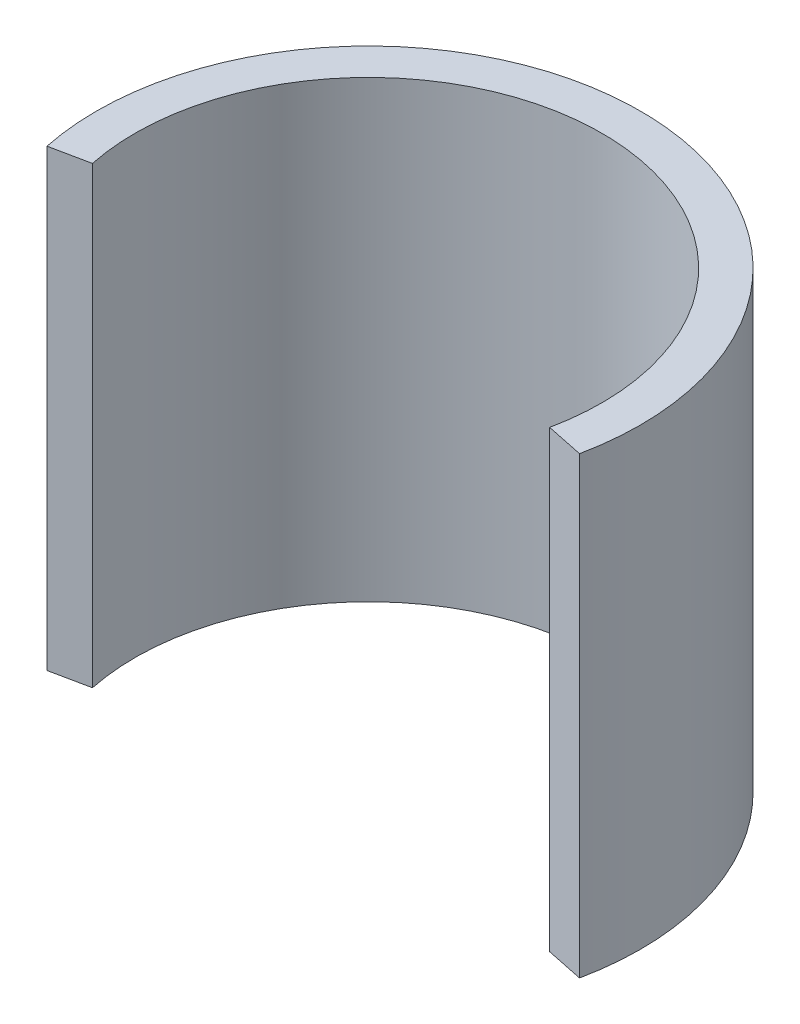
from build123d import *

# Parameters (mm, degrees)
EXTRUDE_THIN1_DEPTH = 59


with BuildPart() as part:
    # Sketch1 → Extrude-Thin1 (new body)
    with BuildSketch(Plane(origin=(0, 0, 0), x_dir=(1, 0, 0), z_dir=(0, 1, 0))):
        with BuildLine():
            ThreePointArc((0, 0), (34.598598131, 42.511366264), (69.197196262, 0))
            Line((69.197196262, 0), (64.301400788, 1.015473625))
            ThreePointArc((64.301400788, 1.015473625), (34.598598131, 37.511366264), (4.895795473, 1.015473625))
            Line((4.895795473, 1.015473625), (0, 0))
        make_face()
    extrude(amount=EXTRUDE_THIN1_DEPTH)


solid = part.part
